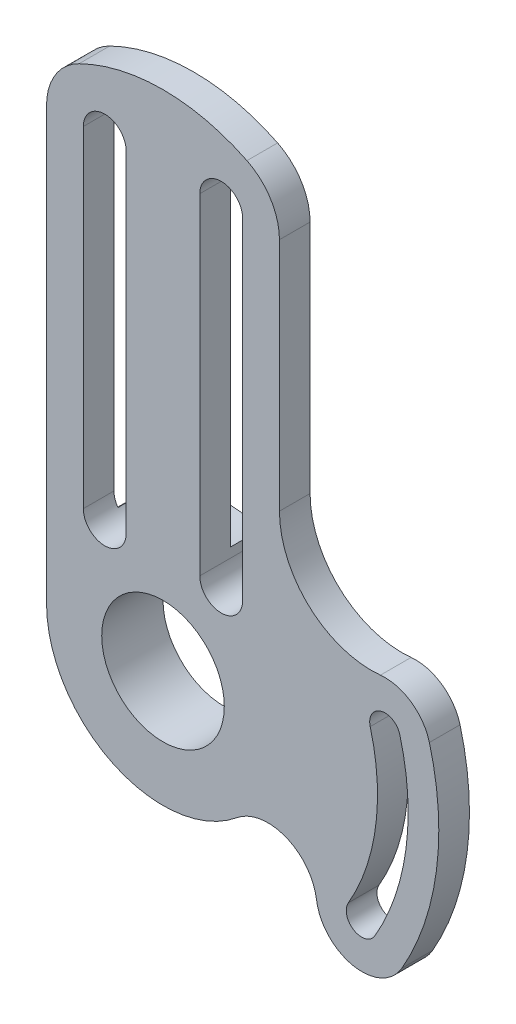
ISO-10303-21;
HEADER;
FILE_DESCRIPTION(('STEP AP214'),'2;1');
FILE_NAME('part.step','',(''),(''),'','','');
FILE_SCHEMA(('AUTOMOTIVE_DESIGN { 1 0 10303 214 1 1 1 1 }'));
ENDSEC;
DATA;
#1=APPLICATION_CONTEXT('core data for automotive mechanical design processes');
#2=APPLICATION_PROTOCOL_DEFINITION('international standard','automotive_design',2000,#1);
#3=PRODUCT_CONTEXT('',#1,'mechanical');
#4=PRODUCT('Part','Part','',(#3));
#5=PRODUCT_RELATED_PRODUCT_CATEGORY('part','',(#4));
#6=PRODUCT_DEFINITION_FORMATION('','',#4);
#7=PRODUCT_DEFINITION_CONTEXT('part definition',#1,'design');
#8=PRODUCT_DEFINITION('design','',#6,#7);
#9=PRODUCT_DEFINITION_SHAPE('','',#8);
#10=(LENGTH_UNIT() NAMED_UNIT(*) SI_UNIT(.MILLI.,.METRE.));
#11=(NAMED_UNIT(*) PLANE_ANGLE_UNIT() SI_UNIT($,.RADIAN.));
#12=(NAMED_UNIT(*) SI_UNIT($,.STERADIAN.) SOLID_ANGLE_UNIT());
#13=UNCERTAINTY_MEASURE_WITH_UNIT(LENGTH_MEASURE(1.E-05),#10,'distance_accuracy_value','');
#14=(GEOMETRIC_REPRESENTATION_CONTEXT(3) GLOBAL_UNCERTAINTY_ASSIGNED_CONTEXT((#13)) GLOBAL_UNIT_ASSIGNED_CONTEXT((#10,
#11,#12)) REPRESENTATION_CONTEXT('',''));
#15=CARTESIAN_POINT('',(0.,0.,0.));
#16=DIRECTION('',(0.,0.,1.));
#17=DIRECTION('',(1.,0.,0.));
#18=AXIS2_PLACEMENT_3D('',#15,#16,#17);
#19=CARTESIAN_POINT('',(-38.,-64.191412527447,10.));
#20=DIRECTION('',(0.,0.,-1.));
#21=DIRECTION('',(-1.,0.,0.));
#22=AXIS2_PLACEMENT_3D('',#19,#20,#21);
#23=CYLINDRICAL_SURFACE('',#22,38.);
#24=CARTESIAN_POINT('',(-38.,-64.191412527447,0.));
#25=DIRECTION('',(0.,0.,-1.));
#26=DIRECTION('',(-1.,0.,0.));
#27=AXIS2_PLACEMENT_3D('',#24,#25,#26);
#28=CIRCLE('',#27,38.);
#29=CARTESIAN_POINT('',(-76.,-64.191412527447,0.));
#30=VERTEX_POINT('',#29);
#31=CARTESIAN_POINT('',(-62.7140407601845,-35.3259281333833,0.));
#32=VERTEX_POINT('',#31);
#33=EDGE_CURVE('E256',#30,#32,#28,.T.);
#34=ORIENTED_EDGE('',*,*,#33,.T.);
#35=DIRECTION('',(0.,0.,1.));
#36=VECTOR('',#35,1.);
#37=CARTESIAN_POINT('',(-62.7140407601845,-35.3259281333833,-10.));
#38=LINE('',#37,#36);
#39=CARTESIAN_POINT('',(-62.7140407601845,-35.3259281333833,-10.));
#40=VERTEX_POINT('',#39);
#41=EDGE_CURVE('E241',#40,#32,#38,.T.);
#42=ORIENTED_EDGE('',*,*,#41,.F.);
#43=CARTESIAN_POINT('',(-38.,-64.191412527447,-10.));
#44=DIRECTION('',(0.,0.,-1.));
#45=DIRECTION('',(-1.,0.,0.));
#46=AXIS2_PLACEMENT_3D('',#43,#44,#45);
#47=CIRCLE('',#46,38.);
#48=CARTESIAN_POINT('',(-13.2859592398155,-35.3259281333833,-10.));
#49=VERTEX_POINT('',#48);
#50=EDGE_CURVE('E238',#49,#40,#47,.T.);
#51=ORIENTED_EDGE('',*,*,#50,.F.);
#52=DIRECTION('',(0.,0.,1.));
#53=VECTOR('',#52,1.);
#54=CARTESIAN_POINT('',(-13.2859592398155,-35.3259281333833,-10.));
#55=LINE('',#54,#53);
#56=CARTESIAN_POINT('',(-13.2859592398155,-35.3259281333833,0.));
#57=VERTEX_POINT('',#56);
#58=EDGE_CURVE('E250',#49,#57,#55,.T.);
#59=ORIENTED_EDGE('',*,*,#58,.T.);
#60=CARTESIAN_POINT('',(-13.9016802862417,-93.5728860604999,0.));
#61=VERTEX_POINT('',#60);
#62=EDGE_CURVE('E42',#57,#61,#28,.T.);
#63=ORIENTED_EDGE('',*,*,#62,.T.);
#64=DIRECTION('',(0.,0.,-1.));
#65=VECTOR('',#64,1.);
#66=CARTESIAN_POINT('',(-13.9016802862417,-93.5728860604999,10.));
#67=LINE('',#66,#65);
#68=CARTESIAN_POINT('',(-13.9016802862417,-93.5728860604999,10.));
#69=VERTEX_POINT('',#68);
#70=EDGE_CURVE('E270',#69,#61,#67,.T.);
#71=ORIENTED_EDGE('',*,*,#70,.F.);
#72=CARTESIAN_POINT('',(-38.,-64.191412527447,10.));
#73=DIRECTION('',(0.,0.,1.));
#74=DIRECTION('',(1.,0.,0.));
#75=AXIS2_PLACEMENT_3D('',#72,#73,#74);
#76=CIRCLE('',#75,38.);
#77=CARTESIAN_POINT('',(-76.,-64.191412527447,10.));
#78=VERTEX_POINT('',#77);
#79=EDGE_CURVE('E381',#78,#69,#76,.T.);
#80=ORIENTED_EDGE('',*,*,#79,.F.);
#81=DIRECTION('',(0.,0.,-1.));
#82=VECTOR('',#81,1.);
#83=CARTESIAN_POINT('',(-76.,-64.191412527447,10.));
#84=LINE('',#83,#82);
#85=EDGE_CURVE('E273',#78,#30,#84,.T.);
#86=ORIENTED_EDGE('',*,*,#85,.T.);
#87=EDGE_LOOP('',(#34,#42,#51,#59,#63,#71,#80,#86));
#88=FACE_BOUND('',#87,.T.);
#89=ADVANCED_FACE('F33',(#88),#23,.T.);
#90=CARTESIAN_POINT('',(30.,0.,0.));
#91=DIRECTION('',(0.,0.,1.));
#92=DIRECTION('',(1.,0.,0.));
#93=AXIS2_PLACEMENT_3D('',#90,#91,#92);
#94=PLANE('',#93);
#95=CARTESIAN_POINT('',(26.8005413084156,-101.95236916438,0.));
#96=DIRECTION('',(0.,0.,1.));
#97=DIRECTION('',(1.,0.,0.));
#98=AXIS2_PLACEMENT_3D('',#95,#96,#97);
#99=CIRCLE('',#98,5.00000000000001);
#100=CARTESIAN_POINT('',(22.4805052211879,-99.434972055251,0.));
#101=VERTEX_POINT('',#100);
#102=CARTESIAN_POINT('',(31.1205773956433,-104.469766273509,0.));
#103=VERTEX_POINT('',#102);
#104=EDGE_CURVE('E465',#101,#103,#99,.T.);
#105=ORIENTED_EDGE('',*,*,#104,.T.);
#106=CARTESIAN_POINT('',(-38.,-64.191412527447,0.));
#107=DIRECTION('',(0.,0.,1.));
#108=DIRECTION('',(1.,0.,0.));
#109=AXIS2_PLACEMENT_3D('',#106,#107,#108);
#110=CIRCLE('',#109,80.);
#111=CARTESIAN_POINT('',(39.2740661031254,-43.4858889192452,0.));
#112=VERTEX_POINT('',#111);
#113=EDGE_CURVE('E462',#103,#112,#110,.T.);
#114=ORIENTED_EDGE('',*,*,#113,.T.);
#115=CARTESIAN_POINT('',(34.4444369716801,-44.7799841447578,0.));
#116=DIRECTION('',(0.,0.,1.));
#117=DIRECTION('',(1.,0.,0.));
#118=AXIS2_PLACEMENT_3D('',#115,#116,#117);
#119=CIRCLE('',#118,5.00000000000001);
#120=CARTESIAN_POINT('',(29.6148078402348,-46.0740793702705,0.));
#121=VERTEX_POINT('',#120);
#122=EDGE_CURVE('E459',#112,#121,#119,.T.);
#123=ORIENTED_EDGE('',*,*,#122,.T.);
#124=CARTESIAN_POINT('',(-38.,-64.191412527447,0.));
#125=DIRECTION('',(0.,0.,-1.));
#126=DIRECTION('',(1.,0.,0.));
#127=AXIS2_PLACEMENT_3D('',#124,#125,#126);
#128=CIRCLE('',#127,70.);
#129=EDGE_CURVE('E455',#121,#101,#128,.T.);
#130=ORIENTED_EDGE('',*,*,#129,.T.);
#131=EDGE_LOOP('',(#105,#114,#123,#130));
#132=FACE_BOUND('',#131,.T.);
#133=ORIENTED_EDGE('',*,*,#33,.F.);
#134=DIRECTION('',(0.,-1.,0.));
#135=VECTOR('',#134,1.);
#136=CARTESIAN_POINT('',(-76.,-64.191412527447,0.));
#137=LINE('',#136,#135);
#138=CARTESIAN_POINT('',(-76.,76.7175528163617,0.));
#139=VERTEX_POINT('',#138);
#140=EDGE_CURVE('E280',#139,#30,#137,.T.);
#141=ORIENTED_EDGE('',*,*,#140,.F.);
#142=CARTESIAN_POINT('',(-57.,76.7175528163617,0.));
#143=DIRECTION('',(0.,0.,1.));
#144=DIRECTION('',(-1.,0.,0.));
#145=AXIS2_PLACEMENT_3D('',#142,#143,#144);
#146=CIRCLE('',#145,19.);
#147=CARTESIAN_POINT('',(-65.3953488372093,93.7621448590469,0.));
#148=VERTEX_POINT('',#147);
#149=EDGE_CURVE('E285',#148,#139,#146,.T.);
#150=ORIENTED_EDGE('',*,*,#149,.F.);
#151=CARTESIAN_POINT('',(-38.,38.1429497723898,0.));
#152=DIRECTION('',(0.,0.,1.));
#153=DIRECTION('',(-1.,0.,0.));
#154=AXIS2_PLACEMENT_3D('',#151,#152,#153);
#155=CIRCLE('',#154,62.);
#156=CARTESIAN_POINT('',(-10.6046511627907,93.7621448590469,0.));
#157=VERTEX_POINT('',#156);
#158=EDGE_CURVE('E340',#157,#148,#155,.T.);
#159=ORIENTED_EDGE('',*,*,#158,.F.);
#160=CARTESIAN_POINT('',(-19.,76.7175528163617,0.));
#161=DIRECTION('',(0.,0.,1.));
#162=DIRECTION('',(-1.,0.,0.));
#163=AXIS2_PLACEMENT_3D('',#160,#161,#162);
#164=CIRCLE('',#163,19.);
#165=CARTESIAN_POINT('',(0.,76.7175528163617,0.));
#166=VERTEX_POINT('',#165);
#167=EDGE_CURVE('E331',#166,#157,#164,.T.);
#168=ORIENTED_EDGE('',*,*,#167,.F.);
#169=DIRECTION('',(0.,1.,0.));
#170=VECTOR('',#169,1.);
#171=CARTESIAN_POINT('',(0.,0.,0.));
#172=LINE('',#171,#170);
#173=CARTESIAN_POINT('',(0.,0.,0.));
#174=VERTEX_POINT('',#173);
#175=EDGE_CURVE('E317',#174,#166,#172,.T.);
#176=ORIENTED_EDGE('',*,*,#175,.F.);
#177=CARTESIAN_POINT('',(30.,0.,0.));
#178=DIRECTION('',(0.,0.,-1.));
#179=DIRECTION('',(1.,0.,0.));
#180=AXIS2_PLACEMENT_3D('',#177,#178,#179);
#181=CIRCLE('',#180,30.);
#182=CARTESIAN_POINT('',(32.9629579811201,-29.8533227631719,0.));
#183=VERTEX_POINT('',#182);
#184=EDGE_CURVE('E324',#183,#174,#181,.T.);
#185=ORIENTED_EDGE('',*,*,#184,.F.);
#186=CARTESIAN_POINT('',(34.4444369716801,-44.7799841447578,0.));
#187=DIRECTION('',(0.,0.,1.));
#188=DIRECTION('',(1.,0.,0.));
#189=AXIS2_PLACEMENT_3D('',#186,#187,#188);
#190=CIRCLE('',#189,15.);
#191=CARTESIAN_POINT('',(48.9333243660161,-40.89769846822,0.));
#192=VERTEX_POINT('',#191);
#193=EDGE_CURVE('E346',#192,#183,#190,.T.);
#194=ORIENTED_EDGE('',*,*,#193,.F.);
#195=CARTESIAN_POINT('',(-38.,-64.191412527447,0.));
#196=DIRECTION('',(0.,0.,1.));
#197=DIRECTION('',(1.,0.,0.));
#198=AXIS2_PLACEMENT_3D('',#195,#196,#197);
#199=CIRCLE('',#198,90.);
#200=CARTESIAN_POINT('',(39.9422863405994,-109.191412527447,0.));
#201=VERTEX_POINT('',#200);
#202=EDGE_CURVE('E344',#201,#192,#199,.T.);
#203=ORIENTED_EDGE('',*,*,#202,.F.);
#204=CARTESIAN_POINT('',(26.9519052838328,-101.691412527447,0.));
#205=DIRECTION('',(0.,0.,1.));
#206=DIRECTION('',(1.,0.,0.));
#207=AXIS2_PLACEMENT_3D('',#204,#205,#206);
#208=CIRCLE('',#207,15.);
#209=CARTESIAN_POINT('',(12.0937159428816,-103.749132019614,0.));
#210=VERTEX_POINT('',#209);
#211=EDGE_CURVE('E279',#210,#201,#208,.T.);
#212=ORIENTED_EDGE('',*,*,#211,.F.);
#213=CARTESIAN_POINT('',(-3.75501935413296,-105.944032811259,0.));
#214=DIRECTION('',(0.,0.,-1.));
#215=DIRECTION('',(-1.,0.,0.));
#216=AXIS2_PLACEMENT_3D('',#213,#214,#215);
#217=CIRCLE('',#216,16.);
#218=EDGE_CURVE('E277',#61,#210,#217,.T.);
#219=ORIENTED_EDGE('',*,*,#218,.F.);
#220=ORIENTED_EDGE('',*,*,#62,.F.);
#221=CARTESIAN_POINT('',(-19.,-31.2824471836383,0.));
#222=DIRECTION('',(0.,0.,1.));
#223=DIRECTION('',(1.,0.,0.));
#224=AXIS2_PLACEMENT_3D('',#221,#222,#223);
#225=CIRCLE('',#224,7.);
#226=CARTESIAN_POINT('',(-12.,-31.2824471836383,0.));
#227=VERTEX_POINT('',#226);
#228=EDGE_CURVE('E429',#57,#227,#225,.T.);
#229=ORIENTED_EDGE('',*,*,#228,.T.);
#230=DIRECTION('',(0.,1.,0.));
#231=VECTOR('',#230,1.);
#232=CARTESIAN_POINT('',(-12.,76.7175528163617,0.));
#233=LINE('',#232,#231);
#234=CARTESIAN_POINT('',(-12.,76.7175528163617,0.));
#235=VERTEX_POINT('',#234);
#236=EDGE_CURVE('E425',#227,#235,#233,.T.);
#237=ORIENTED_EDGE('',*,*,#236,.T.);
#238=CARTESIAN_POINT('',(-19.,76.7175528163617,0.));
#239=DIRECTION('',(0.,0.,1.));
#240=DIRECTION('',(1.,0.,0.));
#241=AXIS2_PLACEMENT_3D('',#238,#239,#240);
#242=CIRCLE('',#241,7.);
#243=CARTESIAN_POINT('',(-26.,76.7175528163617,0.));
#244=VERTEX_POINT('',#243);
#245=EDGE_CURVE('E434',#235,#244,#242,.T.);
#246=ORIENTED_EDGE('',*,*,#245,.T.);
#247=DIRECTION('',(0.,-1.,0.));
#248=VECTOR('',#247,1.);
#249=CARTESIAN_POINT('',(-26.,76.7175528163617,0.));
#250=LINE('',#249,#248);
#251=CARTESIAN_POINT('',(-26.,-28.1358997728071,0.));
#252=VERTEX_POINT('',#251);
#253=EDGE_CURVE('E431',#244,#252,#250,.T.);
#254=ORIENTED_EDGE('',*,*,#253,.T.);
#255=CARTESIAN_POINT('',(-50.,-28.1358997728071,0.));
#256=VERTEX_POINT('',#255);
#257=EDGE_CURVE('E11',#256,#252,#28,.T.);
#258=ORIENTED_EDGE('',*,*,#257,.F.);
#259=DIRECTION('',(0.,1.,0.));
#260=VECTOR('',#259,1.);
#261=CARTESIAN_POINT('',(-50.,76.7175528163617,0.));
#262=LINE('',#261,#260);
#263=CARTESIAN_POINT('',(-50.,76.7175528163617,0.));
#264=VERTEX_POINT('',#263);
#265=EDGE_CURVE('E397',#256,#264,#262,.T.);
#266=ORIENTED_EDGE('',*,*,#265,.T.);
#267=CARTESIAN_POINT('',(-57.,76.7175528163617,0.));
#268=DIRECTION('',(0.,0.,1.));
#269=DIRECTION('',(1.,0.,0.));
#270=AXIS2_PLACEMENT_3D('',#267,#268,#269);
#271=CIRCLE('',#270,7.);
#272=CARTESIAN_POINT('',(-64.,76.7175528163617,0.));
#273=VERTEX_POINT('',#272);
#274=EDGE_CURVE('E406',#264,#273,#271,.T.);
#275=ORIENTED_EDGE('',*,*,#274,.T.);
#276=DIRECTION('',(0.,-1.,0.));
#277=VECTOR('',#276,1.);
#278=CARTESIAN_POINT('',(-64.,76.7175528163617,0.));
#279=LINE('',#278,#277);
#280=CARTESIAN_POINT('',(-64.,-31.2824471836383,0.));
#281=VERTEX_POINT('',#280);
#282=EDGE_CURVE('E403',#273,#281,#279,.T.);
#283=ORIENTED_EDGE('',*,*,#282,.T.);
#284=CARTESIAN_POINT('',(-57.,-31.2824471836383,0.));
#285=DIRECTION('',(0.,0.,1.));
#286=DIRECTION('',(1.,0.,0.));
#287=AXIS2_PLACEMENT_3D('',#284,#285,#286);
#288=CIRCLE('',#287,7.);
#289=EDGE_CURVE('E400',#281,#32,#288,.T.);
#290=ORIENTED_EDGE('',*,*,#289,.T.);
#291=EDGE_LOOP('',(#133,#141,#150,#159,#168,#176,#185,#194,#203,#212,#219,#220,#229,#237,#246,
#254,#258,#266,#275,#283,#290));
#292=FACE_BOUND('',#291,.T.);
#293=ADVANCED_FACE('F368',(#132,#292),#94,.F.);
#294=CARTESIAN_POINT('',(30.,0.,10.));
#295=DIRECTION('',(0.,0.,1.));
#296=DIRECTION('',(1.,0.,0.));
#297=AXIS2_PLACEMENT_3D('',#294,#295,#296);
#298=PLANE('',#297);
#299=CARTESIAN_POINT('',(-38.,-64.191412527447,10.));
#300=DIRECTION('',(0.,0.,1.));
#301=DIRECTION('',(1.,0.,0.));
#302=AXIS2_PLACEMENT_3D('',#299,#300,#301);
#303=CIRCLE('',#302,80.);
#304=CARTESIAN_POINT('',(31.1205773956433,-104.469766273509,10.));
#305=VERTEX_POINT('',#304);
#306=CARTESIAN_POINT('',(39.2740661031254,-43.4858889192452,10.));
#307=VERTEX_POINT('',#306);
#308=EDGE_CURVE('E472',#305,#307,#303,.T.);
#309=ORIENTED_EDGE('',*,*,#308,.F.);
#310=CARTESIAN_POINT('',(26.8005413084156,-101.95236916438,10.));
#311=DIRECTION('',(0.,0.,1.));
#312=DIRECTION('',(1.,0.,0.));
#313=AXIS2_PLACEMENT_3D('',#310,#311,#312);
#314=CIRCLE('',#313,5.00000000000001);
#315=CARTESIAN_POINT('',(22.4805052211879,-99.434972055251,10.));
#316=VERTEX_POINT('',#315);
#317=EDGE_CURVE('E458',#316,#305,#314,.T.);
#318=ORIENTED_EDGE('',*,*,#317,.F.);
#319=CARTESIAN_POINT('',(-38.,-64.191412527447,10.));
#320=DIRECTION('',(0.,0.,-1.));
#321=DIRECTION('',(1.,0.,0.));
#322=AXIS2_PLACEMENT_3D('',#319,#320,#321);
#323=CIRCLE('',#322,70.);
#324=CARTESIAN_POINT('',(29.6148078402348,-46.0740793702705,10.));
#325=VERTEX_POINT('',#324);
#326=EDGE_CURVE('E454',#325,#316,#323,.T.);
#327=ORIENTED_EDGE('',*,*,#326,.F.);
#328=CARTESIAN_POINT('',(34.4444369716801,-44.7799841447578,10.));
#329=DIRECTION('',(0.,0.,1.));
#330=DIRECTION('',(1.,0.,0.));
#331=AXIS2_PLACEMENT_3D('',#328,#329,#330);
#332=CIRCLE('',#331,5.00000000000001);
#333=EDGE_CURVE('E469',#307,#325,#332,.T.);
#334=ORIENTED_EDGE('',*,*,#333,.F.);
#335=EDGE_LOOP('',(#309,#318,#327,#334));
#336=FACE_BOUND('',#335,.T.);
#337=DIRECTION('',(0.,-1.,0.));
#338=VECTOR('',#337,1.);
#339=CARTESIAN_POINT('',(-64.,76.7175528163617,10.));
#340=LINE('',#339,#338);
#341=CARTESIAN_POINT('',(-64.,76.7175528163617,10.));
#342=VERTEX_POINT('',#341);
#343=CARTESIAN_POINT('',(-64.,-31.2824471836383,10.));
#344=VERTEX_POINT('',#343);
#345=EDGE_CURVE('E412',#342,#344,#340,.T.);
#346=ORIENTED_EDGE('',*,*,#345,.F.);
#347=CARTESIAN_POINT('',(-57.,76.7175528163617,10.));
#348=DIRECTION('',(0.,0.,1.));
#349=DIRECTION('',(1.,0.,0.));
#350=AXIS2_PLACEMENT_3D('',#347,#348,#349);
#351=CIRCLE('',#350,7.);
#352=CARTESIAN_POINT('',(-50.,76.7175528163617,10.));
#353=VERTEX_POINT('',#352);
#354=EDGE_CURVE('E399',#353,#342,#351,.T.);
#355=ORIENTED_EDGE('',*,*,#354,.F.);
#356=DIRECTION('',(0.,1.,0.));
#357=VECTOR('',#356,1.);
#358=CARTESIAN_POINT('',(-50.,76.7175528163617,10.));
#359=LINE('',#358,#357);
#360=CARTESIAN_POINT('',(-50.,-31.2824471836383,10.));
#361=VERTEX_POINT('',#360);
#362=EDGE_CURVE('E396',#361,#353,#359,.T.);
#363=ORIENTED_EDGE('',*,*,#362,.F.);
#364=CARTESIAN_POINT('',(-57.,-31.2824471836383,10.));
#365=DIRECTION('',(0.,0.,1.));
#366=DIRECTION('',(1.,0.,0.));
#367=AXIS2_PLACEMENT_3D('',#364,#365,#366);
#368=CIRCLE('',#367,7.);
#369=EDGE_CURVE('E223',#344,#361,#368,.T.);
#370=ORIENTED_EDGE('',*,*,#369,.F.);
#371=EDGE_LOOP('',(#346,#355,#363,#370));
#372=FACE_BOUND('',#371,.T.);
#373=CARTESIAN_POINT('',(30.,0.,10.));
#374=DIRECTION('',(0.,0.,-1.));
#375=DIRECTION('',(1.,0.,0.));
#376=AXIS2_PLACEMENT_3D('',#373,#374,#375);
#377=CIRCLE('',#376,30.);
#378=CARTESIAN_POINT('',(32.9629579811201,-29.8533227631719,10.));
#379=VERTEX_POINT('',#378);
#380=CARTESIAN_POINT('',(0.,0.,10.));
#381=VERTEX_POINT('',#380);
#382=EDGE_CURVE('E348',#379,#381,#377,.T.);
#383=ORIENTED_EDGE('',*,*,#382,.T.);
#384=DIRECTION('',(0.,1.,0.));
#385=VECTOR('',#384,1.);
#386=CARTESIAN_POINT('',(0.,0.,10.));
#387=LINE('',#386,#385);
#388=CARTESIAN_POINT('',(0.,76.7175528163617,10.));
#389=VERTEX_POINT('',#388);
#390=EDGE_CURVE('E318',#381,#389,#387,.T.);
#391=ORIENTED_EDGE('',*,*,#390,.T.);
#392=CARTESIAN_POINT('',(-19.,76.7175528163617,10.));
#393=DIRECTION('',(0.,0.,1.));
#394=DIRECTION('',(-1.,0.,0.));
#395=AXIS2_PLACEMENT_3D('',#392,#393,#394);
#396=CIRCLE('',#395,19.);
#397=CARTESIAN_POINT('',(-10.6046511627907,93.7621448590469,10.));
#398=VERTEX_POINT('',#397);
#399=EDGE_CURVE('E389',#389,#398,#396,.T.);
#400=ORIENTED_EDGE('',*,*,#399,.T.);
#401=CARTESIAN_POINT('',(-38.,38.1429497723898,10.));
#402=DIRECTION('',(0.,0.,1.));
#403=DIRECTION('',(-1.,0.,0.));
#404=AXIS2_PLACEMENT_3D('',#401,#402,#403);
#405=CIRCLE('',#404,62.);
#406=CARTESIAN_POINT('',(-65.3953488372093,93.7621448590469,10.));
#407=VERTEX_POINT('',#406);
#408=EDGE_CURVE('E387',#398,#407,#405,.T.);
#409=ORIENTED_EDGE('',*,*,#408,.T.);
#410=CARTESIAN_POINT('',(-57.,76.7175528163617,10.));
#411=DIRECTION('',(0.,0.,1.));
#412=DIRECTION('',(-1.,0.,0.));
#413=AXIS2_PLACEMENT_3D('',#410,#411,#412);
#414=CIRCLE('',#413,19.);
#415=CARTESIAN_POINT('',(-76.,76.7175528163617,10.));
#416=VERTEX_POINT('',#415);
#417=EDGE_CURVE('E385',#407,#416,#414,.T.);
#418=ORIENTED_EDGE('',*,*,#417,.T.);
#419=DIRECTION('',(0.,-1.,0.));
#420=VECTOR('',#419,1.);
#421=CARTESIAN_POINT('',(-76.,-64.191412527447,10.));
#422=LINE('',#421,#420);
#423=EDGE_CURVE('E383',#416,#78,#422,.T.);
#424=ORIENTED_EDGE('',*,*,#423,.T.);
#425=ORIENTED_EDGE('',*,*,#79,.T.);
#426=CARTESIAN_POINT('',(-3.75501935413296,-105.944032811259,10.));
#427=DIRECTION('',(0.,0.,-1.));
#428=DIRECTION('',(-1.,0.,0.));
#429=AXIS2_PLACEMENT_3D('',#426,#427,#428);
#430=CIRCLE('',#429,16.);
#431=CARTESIAN_POINT('',(12.0937159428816,-103.749132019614,10.));
#432=VERTEX_POINT('',#431);
#433=EDGE_CURVE('E377',#69,#432,#430,.T.);
#434=ORIENTED_EDGE('',*,*,#433,.T.);
#435=CARTESIAN_POINT('',(26.9519052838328,-101.691412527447,10.));
#436=DIRECTION('',(0.,0.,1.));
#437=DIRECTION('',(1.,0.,0.));
#438=AXIS2_PLACEMENT_3D('',#435,#436,#437);
#439=CIRCLE('',#438,15.);
#440=CARTESIAN_POINT('',(39.9422863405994,-109.191412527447,10.));
#441=VERTEX_POINT('',#440);
#442=EDGE_CURVE('E364',#432,#441,#439,.T.);
#443=ORIENTED_EDGE('',*,*,#442,.T.);
#444=CARTESIAN_POINT('',(-38.,-64.191412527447,10.));
#445=DIRECTION('',(0.,0.,1.));
#446=DIRECTION('',(1.,0.,0.));
#447=AXIS2_PLACEMENT_3D('',#444,#445,#446);
#448=CIRCLE('',#447,90.);
#449=CARTESIAN_POINT('',(48.9333243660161,-40.89769846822,10.));
#450=VERTEX_POINT('',#449);
#451=EDGE_CURVE('E376',#441,#450,#448,.T.);
#452=ORIENTED_EDGE('',*,*,#451,.T.);
#453=CARTESIAN_POINT('',(34.4444369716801,-44.7799841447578,10.));
#454=DIRECTION('',(0.,0.,1.));
#455=DIRECTION('',(1.,0.,0.));
#456=AXIS2_PLACEMENT_3D('',#453,#454,#455);
#457=CIRCLE('',#456,15.);
#458=EDGE_CURVE('E336',#450,#379,#457,.T.);
#459=ORIENTED_EDGE('',*,*,#458,.T.);
#460=EDGE_LOOP('',(#383,#391,#400,#409,#418,#424,#425,#434,#443,#452,#459));
#461=FACE_BOUND('',#460,.T.);
#462=DIRECTION('',(0.,-1.,0.));
#463=VECTOR('',#462,1.);
#464=CARTESIAN_POINT('',(-26.,76.7175528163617,10.));
#465=LINE('',#464,#463);
#466=CARTESIAN_POINT('',(-26.,76.7175528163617,10.));
#467=VERTEX_POINT('',#466);
#468=CARTESIAN_POINT('',(-26.,-31.2824471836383,10.));
#469=VERTEX_POINT('',#468);
#470=EDGE_CURVE('E442',#467,#469,#465,.T.);
#471=ORIENTED_EDGE('',*,*,#470,.F.);
#472=CARTESIAN_POINT('',(-19.,76.7175528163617,10.));
#473=DIRECTION('',(0.,0.,1.));
#474=DIRECTION('',(1.,0.,0.));
#475=AXIS2_PLACEMENT_3D('',#472,#473,#474);
#476=CIRCLE('',#475,7.);
#477=CARTESIAN_POINT('',(-12.,76.7175528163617,10.));
#478=VERTEX_POINT('',#477);
#479=EDGE_CURVE('E428',#478,#467,#476,.T.);
#480=ORIENTED_EDGE('',*,*,#479,.F.);
#481=DIRECTION('',(0.,1.,0.));
#482=VECTOR('',#481,1.);
#483=CARTESIAN_POINT('',(-12.,76.7175528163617,10.));
#484=LINE('',#483,#482);
#485=CARTESIAN_POINT('',(-12.,-31.2824471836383,10.));
#486=VERTEX_POINT('',#485);
#487=EDGE_CURVE('E424',#486,#478,#484,.T.);
#488=ORIENTED_EDGE('',*,*,#487,.F.);
#489=CARTESIAN_POINT('',(-19.,-31.2824471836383,10.));
#490=DIRECTION('',(0.,0.,1.));
#491=DIRECTION('',(1.,0.,0.));
#492=AXIS2_PLACEMENT_3D('',#489,#490,#491);
#493=CIRCLE('',#492,7.);
#494=EDGE_CURVE('E439',#469,#486,#493,.T.);
#495=ORIENTED_EDGE('',*,*,#494,.F.);
#496=EDGE_LOOP('',(#471,#480,#488,#495));
#497=FACE_BOUND('',#496,.T.);
#498=CARTESIAN_POINT('',(-38.,-64.191412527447,10.));
#499=DIRECTION('',(0.,0.,1.));
#500=DIRECTION('',(1.,0.,0.));
#501=AXIS2_PLACEMENT_3D('',#498,#499,#500);
#502=CIRCLE('',#501,20.);
#503=CARTESIAN_POINT('',(-18.,-64.191412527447,10.));
#504=VERTEX_POINT('',#503);
#505=EDGE_CURVE('E258',#504,#504,#502,.T.);
#506=ORIENTED_EDGE('',*,*,#505,.F.);
#507=EDGE_LOOP('',(#506));
#508=FACE_BOUND('',#507,.T.);
#509=ADVANCED_FACE('F485',(#336,#372,#461,#497,#508),#298,.T.);
#510=CARTESIAN_POINT('',(30.,0.,10.));
#511=DIRECTION('',(0.,0.,-1.));
#512=DIRECTION('',(-1.,0.,0.));
#513=AXIS2_PLACEMENT_3D('',#510,#511,#512);
#514=CYLINDRICAL_SURFACE('',#513,30.);
#515=ORIENTED_EDGE('',*,*,#184,.T.);
#516=DIRECTION('',(0.,0.,-1.));
#517=VECTOR('',#516,1.);
#518=CARTESIAN_POINT('',(0.,0.,10.));
#519=LINE('',#518,#517);
#520=EDGE_CURVE('E266',#381,#174,#519,.T.);
#521=ORIENTED_EDGE('',*,*,#520,.F.);
#522=ORIENTED_EDGE('',*,*,#382,.F.);
#523=DIRECTION('',(0.,0.,-1.));
#524=VECTOR('',#523,1.);
#525=CARTESIAN_POINT('',(32.9629579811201,-29.8533227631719,10.));
#526=LINE('',#525,#524);
#527=EDGE_CURVE('E326',#379,#183,#526,.T.);
#528=ORIENTED_EDGE('',*,*,#527,.T.);
#529=EDGE_LOOP('',(#515,#521,#522,#528));
#530=FACE_BOUND('',#529,.T.);
#531=ADVANCED_FACE('F35',(#530),#514,.F.);
#532=CARTESIAN_POINT('',(0.,0.,10.));
#533=DIRECTION('',(-1.,0.,0.));
#534=DIRECTION('',(0.,0.,1.));
#535=AXIS2_PLACEMENT_3D('',#532,#533,#534);
#536=PLANE('',#535);
#537=ORIENTED_EDGE('',*,*,#175,.T.);
#538=DIRECTION('',(0.,0.,-1.));
#539=VECTOR('',#538,1.);
#540=CARTESIAN_POINT('',(0.,76.7175528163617,10.));
#541=LINE('',#540,#539);
#542=EDGE_CURVE('E306',#389,#166,#541,.T.);
#543=ORIENTED_EDGE('',*,*,#542,.F.);
#544=ORIENTED_EDGE('',*,*,#390,.F.);
#545=ORIENTED_EDGE('',*,*,#520,.T.);
#546=EDGE_LOOP('',(#537,#543,#544,#545));
#547=FACE_BOUND('',#546,.T.);
#548=ADVANCED_FACE('F316',(#547),#536,.F.);
#549=CARTESIAN_POINT('',(-19.,76.7175528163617,10.));
#550=DIRECTION('',(0.,0.,-1.));
#551=DIRECTION('',(-1.,0.,0.));
#552=AXIS2_PLACEMENT_3D('',#549,#550,#551);
#553=CYLINDRICAL_SURFACE('',#552,19.);
#554=ORIENTED_EDGE('',*,*,#167,.T.);
#555=DIRECTION('',(0.,0.,-1.));
#556=VECTOR('',#555,1.);
#557=CARTESIAN_POINT('',(-10.6046511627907,93.7621448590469,10.));
#558=LINE('',#557,#556);
#559=EDGE_CURVE('E300',#398,#157,#558,.T.);
#560=ORIENTED_EDGE('',*,*,#559,.F.);
#561=ORIENTED_EDGE('',*,*,#399,.F.);
#562=ORIENTED_EDGE('',*,*,#542,.T.);
#563=EDGE_LOOP('',(#554,#560,#561,#562));
#564=FACE_BOUND('',#563,.T.);
#565=ADVANCED_FACE('F555',(#564),#553,.T.);
#566=CARTESIAN_POINT('',(-38.,38.1429497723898,10.));
#567=DIRECTION('',(0.,0.,-1.));
#568=DIRECTION('',(-1.,0.,0.));
#569=AXIS2_PLACEMENT_3D('',#566,#567,#568);
#570=CYLINDRICAL_SURFACE('',#569,62.);
#571=ORIENTED_EDGE('',*,*,#158,.T.);
#572=DIRECTION('',(0.,0.,-1.));
#573=VECTOR('',#572,1.);
#574=CARTESIAN_POINT('',(-65.3953488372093,93.7621448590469,10.));
#575=LINE('',#574,#573);
#576=EDGE_CURVE('E293',#407,#148,#575,.T.);
#577=ORIENTED_EDGE('',*,*,#576,.F.);
#578=ORIENTED_EDGE('',*,*,#408,.F.);
#579=ORIENTED_EDGE('',*,*,#559,.T.);
#580=EDGE_LOOP('',(#571,#577,#578,#579));
#581=FACE_BOUND('',#580,.T.);
#582=ADVANCED_FACE('F560',(#581),#570,.T.);
#583=CARTESIAN_POINT('',(-57.,76.7175528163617,10.));
#584=DIRECTION('',(0.,0.,-1.));
#585=DIRECTION('',(-1.,0.,0.));
#586=AXIS2_PLACEMENT_3D('',#583,#584,#585);
#587=CYLINDRICAL_SURFACE('',#586,19.);
#588=ORIENTED_EDGE('',*,*,#149,.T.);
#589=DIRECTION('',(0.,0.,-1.));
#590=VECTOR('',#589,1.);
#591=CARTESIAN_POINT('',(-76.,76.7175528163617,10.));
#592=LINE('',#591,#590);
#593=EDGE_CURVE('E288',#416,#139,#592,.T.);
#594=ORIENTED_EDGE('',*,*,#593,.F.);
#595=ORIENTED_EDGE('',*,*,#417,.F.);
#596=ORIENTED_EDGE('',*,*,#576,.T.);
#597=EDGE_LOOP('',(#588,#594,#595,#596));
#598=FACE_BOUND('',#597,.T.);
#599=ADVANCED_FACE('F523',(#598),#587,.T.);
#600=CARTESIAN_POINT('',(-76.,-64.191412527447,10.));
#601=DIRECTION('',(1.,0.,0.));
#602=DIRECTION('',(0.,1.,0.));
#603=AXIS2_PLACEMENT_3D('',#600,#601,#602);
#604=PLANE('',#603);
#605=ORIENTED_EDGE('',*,*,#140,.T.);
#606=ORIENTED_EDGE('',*,*,#85,.F.);
#607=ORIENTED_EDGE('',*,*,#423,.F.);
#608=ORIENTED_EDGE('',*,*,#593,.T.);
#609=EDGE_LOOP('',(#605,#606,#607,#608));
#610=FACE_BOUND('',#609,.T.);
#611=ADVANCED_FACE('F516',(#610),#604,.F.);
#612=CARTESIAN_POINT('',(-50.,-28.1358997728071,-10.));
#613=VERTEX_POINT('',#612);
#614=CARTESIAN_POINT('',(-26.,-28.1358997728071,-10.));
#615=VERTEX_POINT('',#614);
#616=EDGE_CURVE('E259',#613,#615,#47,.T.);
#617=ORIENTED_EDGE('',*,*,#616,.F.);
#618=DIRECTION('',(0.,0.,1.));
#619=VECTOR('',#618,1.);
#620=CARTESIAN_POINT('',(-50.,-28.1358997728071,-10.));
#621=LINE('',#620,#619);
#622=EDGE_CURVE('E50',#613,#256,#621,.T.);
#623=ORIENTED_EDGE('',*,*,#622,.T.);
#624=ORIENTED_EDGE('',*,*,#257,.T.);
#625=DIRECTION('',(0.,0.,1.));
#626=VECTOR('',#625,1.);
#627=CARTESIAN_POINT('',(-26.,-28.1358997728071,-10.));
#628=LINE('',#627,#626);
#629=EDGE_CURVE('E249',#615,#252,#628,.T.);
#630=ORIENTED_EDGE('',*,*,#629,.F.);
#631=EDGE_LOOP('',(#617,#623,#624,#630));
#632=FACE_BOUND('',#631,.T.);
#633=ADVANCED_FACE('F507',(#632),#23,.T.);
#634=CARTESIAN_POINT('',(-3.75501935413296,-105.944032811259,10.));
#635=DIRECTION('',(0.,0.,-1.));
#636=DIRECTION('',(-1.,0.,0.));
#637=AXIS2_PLACEMENT_3D('',#634,#635,#636);
#638=CYLINDRICAL_SURFACE('',#637,16.);
#639=ORIENTED_EDGE('',*,*,#218,.T.);
#640=DIRECTION('',(0.,0.,-1.));
#641=VECTOR('',#640,1.);
#642=CARTESIAN_POINT('',(12.0937159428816,-103.749132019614,10.));
#643=LINE('',#642,#641);
#644=EDGE_CURVE('E274',#432,#210,#643,.T.);
#645=ORIENTED_EDGE('',*,*,#644,.F.);
#646=ORIENTED_EDGE('',*,*,#433,.F.);
#647=ORIENTED_EDGE('',*,*,#70,.T.);
#648=EDGE_LOOP('',(#639,#645,#646,#647));
#649=FACE_BOUND('',#648,.T.);
#650=ADVANCED_FACE('F515',(#649),#638,.F.);
#651=CARTESIAN_POINT('',(26.9519052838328,-101.691412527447,10.));
#652=DIRECTION('',(0.,0.,-1.));
#653=DIRECTION('',(-1.,0.,0.));
#654=AXIS2_PLACEMENT_3D('',#651,#652,#653);
#655=CYLINDRICAL_SURFACE('',#654,15.);
#656=ORIENTED_EDGE('',*,*,#211,.T.);
#657=DIRECTION('',(0.,0.,-1.));
#658=VECTOR('',#657,1.);
#659=CARTESIAN_POINT('',(39.9422863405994,-109.191412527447,10.));
#660=LINE('',#659,#658);
#661=EDGE_CURVE('E352',#441,#201,#660,.T.);
#662=ORIENTED_EDGE('',*,*,#661,.F.);
#663=ORIENTED_EDGE('',*,*,#442,.F.);
#664=ORIENTED_EDGE('',*,*,#644,.T.);
#665=EDGE_LOOP('',(#656,#662,#663,#664));
#666=FACE_BOUND('',#665,.T.);
#667=ADVANCED_FACE('F363',(#666),#655,.T.);
#668=CARTESIAN_POINT('',(-38.,-64.191412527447,10.));
#669=DIRECTION('',(0.,0.,-1.));
#670=DIRECTION('',(-1.,0.,0.));
#671=AXIS2_PLACEMENT_3D('',#668,#669,#670);
#672=CYLINDRICAL_SURFACE('',#671,90.);
#673=ORIENTED_EDGE('',*,*,#202,.T.);
#674=DIRECTION('',(0.,0.,-1.));
#675=VECTOR('',#674,1.);
#676=CARTESIAN_POINT('',(48.9333243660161,-40.89769846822,10.));
#677=LINE('',#676,#675);
#678=EDGE_CURVE('E350',#450,#192,#677,.T.);
#679=ORIENTED_EDGE('',*,*,#678,.F.);
#680=ORIENTED_EDGE('',*,*,#451,.F.);
#681=ORIENTED_EDGE('',*,*,#661,.T.);
#682=EDGE_LOOP('',(#673,#679,#680,#681));
#683=FACE_BOUND('',#682,.T.);
#684=ADVANCED_FACE('F371',(#683),#672,.T.);
#685=CARTESIAN_POINT('',(34.4444369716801,-44.7799841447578,10.));
#686=DIRECTION('',(0.,0.,-1.));
#687=DIRECTION('',(-1.,0.,0.));
#688=AXIS2_PLACEMENT_3D('',#685,#686,#687);
#689=CYLINDRICAL_SURFACE('',#688,15.);
#690=ORIENTED_EDGE('',*,*,#193,.T.);
#691=ORIENTED_EDGE('',*,*,#527,.F.);
#692=ORIENTED_EDGE('',*,*,#458,.F.);
#693=ORIENTED_EDGE('',*,*,#678,.T.);
#694=EDGE_LOOP('',(#690,#691,#692,#693));
#695=FACE_BOUND('',#694,.T.);
#696=ADVANCED_FACE('F374',(#695),#689,.T.);
#697=CARTESIAN_POINT('',(-57.,76.7175528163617,10.));
#698=DIRECTION('',(0.,0.,-1.));
#699=DIRECTION('',(-1.,0.,0.));
#700=AXIS2_PLACEMENT_3D('',#697,#698,#699);
#701=CYLINDRICAL_SURFACE('',#700,7.);
#702=ORIENTED_EDGE('',*,*,#274,.F.);
#703=DIRECTION('',(0.,0.,-1.));
#704=VECTOR('',#703,1.);
#705=CARTESIAN_POINT('',(-50.,76.7175528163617,10.));
#706=LINE('',#705,#704);
#707=EDGE_CURVE('E226',#353,#264,#706,.T.);
#708=ORIENTED_EDGE('',*,*,#707,.F.);
#709=ORIENTED_EDGE('',*,*,#354,.T.);
#710=DIRECTION('',(0.,0.,-1.));
#711=VECTOR('',#710,1.);
#712=CARTESIAN_POINT('',(-64.,76.7175528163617,10.));
#713=LINE('',#712,#711);
#714=EDGE_CURVE('E329',#342,#273,#713,.T.);
#715=ORIENTED_EDGE('',*,*,#714,.T.);
#716=EDGE_LOOP('',(#702,#708,#709,#715));
#717=FACE_BOUND('',#716,.T.);
#718=ADVANCED_FACE('F549',(#717),#701,.F.);
#719=CARTESIAN_POINT('',(-64.,76.7175528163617,10.));
#720=DIRECTION('',(1.,0.,0.));
#721=DIRECTION('',(0.,0.,-1.));
#722=AXIS2_PLACEMENT_3D('',#719,#720,#721);
#723=PLANE('',#722);
#724=ORIENTED_EDGE('',*,*,#282,.F.);
#725=ORIENTED_EDGE('',*,*,#714,.F.);
#726=ORIENTED_EDGE('',*,*,#345,.T.);
#727=DIRECTION('',(0.,0.,-1.));
#728=VECTOR('',#727,1.);
#729=CARTESIAN_POINT('',(-64.,-31.2824471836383,10.));
#730=LINE('',#729,#728);
#731=EDGE_CURVE('E225',#344,#281,#730,.T.);
#732=ORIENTED_EDGE('',*,*,#731,.T.);
#733=EDGE_LOOP('',(#724,#725,#726,#732));
#734=FACE_BOUND('',#733,.T.);
#735=ADVANCED_FACE('F546',(#734),#723,.T.);
#736=CARTESIAN_POINT('',(-57.,-31.2824471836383,10.));
#737=DIRECTION('',(0.,0.,-1.));
#738=DIRECTION('',(-1.,0.,0.));
#739=AXIS2_PLACEMENT_3D('',#736,#737,#738);
#740=CYLINDRICAL_SURFACE('',#739,7.);
#741=ORIENTED_EDGE('',*,*,#289,.F.);
#742=ORIENTED_EDGE('',*,*,#731,.F.);
#743=ORIENTED_EDGE('',*,*,#369,.T.);
#744=DIRECTION('',(0.,0.,-1.));
#745=VECTOR('',#744,1.);
#746=CARTESIAN_POINT('',(-50.,-31.2824471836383,10.));
#747=LINE('',#746,#745);
#748=CARTESIAN_POINT('',(-50.,-31.2824471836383,-10.));
#749=VERTEX_POINT('',#748);
#750=EDGE_CURVE('E215',#361,#749,#747,.T.);
#751=ORIENTED_EDGE('',*,*,#750,.T.);
#752=CARTESIAN_POINT('',(-57.,-31.2824471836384,-10.));
#753=DIRECTION('',(0.,0.,1.));
#754=DIRECTION('',(-1.,0.,0.));
#755=AXIS2_PLACEMENT_3D('',#752,#753,#754);
#756=CIRCLE('',#755,6.99999999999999);
#757=EDGE_CURVE('E219',#40,#749,#756,.T.);
#758=ORIENTED_EDGE('',*,*,#757,.F.);
#759=ORIENTED_EDGE('',*,*,#41,.T.);
#760=EDGE_LOOP('',(#741,#742,#743,#751,#758,#759));
#761=FACE_BOUND('',#760,.T.);
#762=ADVANCED_FACE('F217',(#761),#740,.F.);
#763=CARTESIAN_POINT('',(-50.,76.7175528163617,10.));
#764=DIRECTION('',(-1.,0.,0.));
#765=DIRECTION('',(0.,0.,1.));
#766=AXIS2_PLACEMENT_3D('',#763,#764,#765);
#767=PLANE('',#766);
#768=ORIENTED_EDGE('',*,*,#265,.F.);
#769=ORIENTED_EDGE('',*,*,#622,.F.);
#770=DIRECTION('',(0.,1.,0.));
#771=VECTOR('',#770,1.);
#772=CARTESIAN_POINT('',(-50.,-28.1358997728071,-10.));
#773=LINE('',#772,#771);
#774=EDGE_CURVE('E228',#749,#613,#773,.T.);
#775=ORIENTED_EDGE('',*,*,#774,.F.);
#776=ORIENTED_EDGE('',*,*,#750,.F.);
#777=ORIENTED_EDGE('',*,*,#362,.T.);
#778=ORIENTED_EDGE('',*,*,#707,.T.);
#779=EDGE_LOOP('',(#768,#769,#775,#776,#777,#778));
#780=FACE_BOUND('',#779,.T.);
#781=ADVANCED_FACE('F229',(#780),#767,.T.);
#782=CARTESIAN_POINT('',(-19.,76.7175528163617,10.));
#783=DIRECTION('',(0.,0.,-1.));
#784=DIRECTION('',(-1.,0.,0.));
#785=AXIS2_PLACEMENT_3D('',#782,#783,#784);
#786=CYLINDRICAL_SURFACE('',#785,7.);
#787=ORIENTED_EDGE('',*,*,#245,.F.);
#788=DIRECTION('',(0.,0.,-1.));
#789=VECTOR('',#788,1.);
#790=CARTESIAN_POINT('',(-12.,76.7175528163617,10.));
#791=LINE('',#790,#789);
#792=EDGE_CURVE('E421',#478,#235,#791,.T.);
#793=ORIENTED_EDGE('',*,*,#792,.F.);
#794=ORIENTED_EDGE('',*,*,#479,.T.);
#795=DIRECTION('',(0.,0.,-1.));
#796=VECTOR('',#795,1.);
#797=CARTESIAN_POINT('',(-26.,76.7175528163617,10.));
#798=LINE('',#797,#796);
#799=EDGE_CURVE('E409',#467,#244,#798,.T.);
#800=ORIENTED_EDGE('',*,*,#799,.T.);
#801=EDGE_LOOP('',(#787,#793,#794,#800));
#802=FACE_BOUND('',#801,.T.);
#803=ADVANCED_FACE('F531',(#802),#786,.F.);
#804=CARTESIAN_POINT('',(-26.,76.7175528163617,10.));
#805=DIRECTION('',(1.,0.,0.));
#806=DIRECTION('',(0.,1.,0.));
#807=AXIS2_PLACEMENT_3D('',#804,#805,#806);
#808=PLANE('',#807);
#809=ORIENTED_EDGE('',*,*,#253,.F.);
#810=ORIENTED_EDGE('',*,*,#799,.F.);
#811=ORIENTED_EDGE('',*,*,#470,.T.);
#812=DIRECTION('',(0.,0.,-1.));
#813=VECTOR('',#812,1.);
#814=CARTESIAN_POINT('',(-26.,-31.2824471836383,10.));
#815=LINE('',#814,#813);
#816=CARTESIAN_POINT('',(-26.,-31.2824471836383,-10.));
#817=VERTEX_POINT('',#816);
#818=EDGE_CURVE('E58',#469,#817,#815,.T.);
#819=ORIENTED_EDGE('',*,*,#818,.T.);
#820=DIRECTION('',(0.,-1.,0.));
#821=VECTOR('',#820,1.);
#822=CARTESIAN_POINT('',(-26.,-28.1358997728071,-10.));
#823=LINE('',#822,#821);
#824=EDGE_CURVE('E243',#615,#817,#823,.T.);
#825=ORIENTED_EDGE('',*,*,#824,.F.);
#826=ORIENTED_EDGE('',*,*,#629,.T.);
#827=EDGE_LOOP('',(#809,#810,#811,#819,#825,#826));
#828=FACE_BOUND('',#827,.T.);
#829=ADVANCED_FACE('F526',(#828),#808,.T.);
#830=CARTESIAN_POINT('',(-19.,-31.2824471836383,10.));
#831=DIRECTION('',(0.,0.,-1.));
#832=DIRECTION('',(-1.,0.,0.));
#833=AXIS2_PLACEMENT_3D('',#830,#831,#832);
#834=CYLINDRICAL_SURFACE('',#833,7.);
#835=ORIENTED_EDGE('',*,*,#228,.F.);
#836=ORIENTED_EDGE('',*,*,#58,.F.);
#837=CARTESIAN_POINT('',(-19.,-31.2824471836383,-10.));
#838=DIRECTION('',(0.,0.,1.));
#839=DIRECTION('',(1.,0.,0.));
#840=AXIS2_PLACEMENT_3D('',#837,#838,#839);
#841=CIRCLE('',#840,7.);
#842=EDGE_CURVE('E247',#817,#49,#841,.T.);
#843=ORIENTED_EDGE('',*,*,#842,.F.);
#844=ORIENTED_EDGE('',*,*,#818,.F.);
#845=ORIENTED_EDGE('',*,*,#494,.T.);
#846=DIRECTION('',(0.,0.,-1.));
#847=VECTOR('',#846,1.);
#848=CARTESIAN_POINT('',(-12.,-31.2824471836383,10.));
#849=LINE('',#848,#847);
#850=EDGE_CURVE('E418',#486,#227,#849,.T.);
#851=ORIENTED_EDGE('',*,*,#850,.T.);
#852=EDGE_LOOP('',(#835,#836,#843,#844,#845,#851));
#853=FACE_BOUND('',#852,.T.);
#854=ADVANCED_FACE('F542',(#853),#834,.F.);
#855=CARTESIAN_POINT('',(-12.,76.7175528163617,10.));
#856=DIRECTION('',(-1.,0.,0.));
#857=DIRECTION('',(0.,-1.,0.));
#858=AXIS2_PLACEMENT_3D('',#855,#856,#857);
#859=PLANE('',#858);
#860=ORIENTED_EDGE('',*,*,#236,.F.);
#861=ORIENTED_EDGE('',*,*,#850,.F.);
#862=ORIENTED_EDGE('',*,*,#487,.T.);
#863=ORIENTED_EDGE('',*,*,#792,.T.);
#864=EDGE_LOOP('',(#860,#861,#862,#863));
#865=FACE_BOUND('',#864,.T.);
#866=ADVANCED_FACE('F534',(#865),#859,.T.);
#867=CARTESIAN_POINT('',(26.8005413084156,-101.95236916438,10.));
#868=DIRECTION('',(0.,0.,-1.));
#869=DIRECTION('',(-1.,0.,0.));
#870=AXIS2_PLACEMENT_3D('',#867,#868,#869);
#871=CYLINDRICAL_SURFACE('',#870,5.00000000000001);
#872=ORIENTED_EDGE('',*,*,#104,.F.);
#873=DIRECTION('',(0.,0.,-1.));
#874=VECTOR('',#873,1.);
#875=CARTESIAN_POINT('',(22.4805052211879,-99.434972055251,10.));
#876=LINE('',#875,#874);
#877=EDGE_CURVE('E451',#316,#101,#876,.T.);
#878=ORIENTED_EDGE('',*,*,#877,.F.);
#879=ORIENTED_EDGE('',*,*,#317,.T.);
#880=DIRECTION('',(0.,0.,-1.));
#881=VECTOR('',#880,1.);
#882=CARTESIAN_POINT('',(31.1205773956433,-104.469766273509,10.));
#883=LINE('',#882,#881);
#884=EDGE_CURVE('E437',#305,#103,#883,.T.);
#885=ORIENTED_EDGE('',*,*,#884,.T.);
#886=EDGE_LOOP('',(#872,#878,#879,#885));
#887=FACE_BOUND('',#886,.T.);
#888=ADVANCED_FACE('F477',(#887),#871,.F.);
#889=CARTESIAN_POINT('',(-38.,-64.191412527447,10.));
#890=DIRECTION('',(0.,0.,-1.));
#891=DIRECTION('',(-1.,0.,0.));
#892=AXIS2_PLACEMENT_3D('',#889,#890,#891);
#893=CYLINDRICAL_SURFACE('',#892,80.);
#894=ORIENTED_EDGE('',*,*,#113,.F.);
#895=ORIENTED_EDGE('',*,*,#884,.F.);
#896=ORIENTED_EDGE('',*,*,#308,.T.);
#897=DIRECTION('',(0.,0.,-1.));
#898=VECTOR('',#897,1.);
#899=CARTESIAN_POINT('',(39.2740661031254,-43.4858889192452,10.));
#900=LINE('',#899,#898);
#901=EDGE_CURVE('E447',#307,#112,#900,.T.);
#902=ORIENTED_EDGE('',*,*,#901,.T.);
#903=EDGE_LOOP('',(#894,#895,#896,#902));
#904=FACE_BOUND('',#903,.T.);
#905=ADVANCED_FACE('F482',(#904),#893,.F.);
#906=CARTESIAN_POINT('',(34.4444369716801,-44.7799841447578,10.));
#907=DIRECTION('',(0.,0.,-1.));
#908=DIRECTION('',(-1.,0.,0.));
#909=AXIS2_PLACEMENT_3D('',#906,#907,#908);
#910=CYLINDRICAL_SURFACE('',#909,5.00000000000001);
#911=ORIENTED_EDGE('',*,*,#122,.F.);
#912=ORIENTED_EDGE('',*,*,#901,.F.);
#913=ORIENTED_EDGE('',*,*,#333,.T.);
#914=DIRECTION('',(0.,0.,-1.));
#915=VECTOR('',#914,1.);
#916=CARTESIAN_POINT('',(29.6148078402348,-46.0740793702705,10.));
#917=LINE('',#916,#915);
#918=EDGE_CURVE('E449',#325,#121,#917,.T.);
#919=ORIENTED_EDGE('',*,*,#918,.T.);
#920=EDGE_LOOP('',(#911,#912,#913,#919));
#921=FACE_BOUND('',#920,.T.);
#922=ADVANCED_FACE('F489',(#921),#910,.F.);
#923=CARTESIAN_POINT('',(-38.,-64.191412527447,10.));
#924=DIRECTION('',(0.,0.,-1.));
#925=DIRECTION('',(-1.,0.,0.));
#926=AXIS2_PLACEMENT_3D('',#923,#924,#925);
#927=CYLINDRICAL_SURFACE('',#926,70.);
#928=ORIENTED_EDGE('',*,*,#129,.F.);
#929=ORIENTED_EDGE('',*,*,#918,.F.);
#930=ORIENTED_EDGE('',*,*,#326,.T.);
#931=ORIENTED_EDGE('',*,*,#877,.T.);
#932=EDGE_LOOP('',(#928,#929,#930,#931));
#933=FACE_BOUND('',#932,.T.);
#934=ADVANCED_FACE('F493',(#933),#927,.T.);
#935=CARTESIAN_POINT('',(-38.,-64.191412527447,10.));
#936=DIRECTION('',(0.,0.,-1.));
#937=DIRECTION('',(-1.,0.,0.));
#938=AXIS2_PLACEMENT_3D('',#935,#936,#937);
#939=CYLINDRICAL_SURFACE('',#938,20.);
#940=ORIENTED_EDGE('',*,*,#505,.T.);
#941=EDGE_LOOP('',(#940));
#942=FACE_BOUND('',#941,.T.);
#943=CARTESIAN_POINT('',(-38.,-64.191412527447,-10.));
#944=DIRECTION('',(0.,0.,-1.));
#945=DIRECTION('',(-1.,0.,0.));
#946=AXIS2_PLACEMENT_3D('',#943,#944,#945);
#947=CIRCLE('',#946,20.);
#948=CARTESIAN_POINT('',(-58.,-64.191412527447,-10.));
#949=VERTEX_POINT('',#948);
#950=EDGE_CURVE('E252',#949,#949,#947,.T.);
#951=ORIENTED_EDGE('',*,*,#950,.T.);
#952=EDGE_LOOP('',(#951));
#953=FACE_BOUND('',#952,.T.);
#954=ADVANCED_FACE('F495',(#942,#953),#939,.F.);
#955=CARTESIAN_POINT('',(-38.,-64.191412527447,-10.));
#956=DIRECTION('',(0.,0.,-1.));
#957=DIRECTION('',(-1.,0.,0.));
#958=AXIS2_PLACEMENT_3D('',#955,#956,#957);
#959=PLANE('',#958);
#960=ORIENTED_EDGE('',*,*,#757,.T.);
#961=ORIENTED_EDGE('',*,*,#774,.T.);
#962=ORIENTED_EDGE('',*,*,#616,.T.);
#963=ORIENTED_EDGE('',*,*,#824,.T.);
#964=ORIENTED_EDGE('',*,*,#842,.T.);
#965=ORIENTED_EDGE('',*,*,#50,.T.);
#966=EDGE_LOOP('',(#960,#961,#962,#963,#964,#965));
#967=FACE_BOUND('',#966,.T.);
#968=ORIENTED_EDGE('',*,*,#950,.F.);
#969=EDGE_LOOP('',(#968));
#970=FACE_BOUND('',#969,.T.);
#971=ADVANCED_FACE('F234',(#967,#970),#959,.T.);
#972=CLOSED_SHELL('',(#89,#293,#509,#531,#548,#565,#582,#599,#611,#633,#650,#667,#684,#696,#718,
#735,#762,#781,#803,#829,#854,#866,#888,#905,#922,#934,#954,#971));
#973=MANIFOLD_SOLID_BREP('B2',#972);
#974=ADVANCED_BREP_SHAPE_REPRESENTATION('',(#18,#973),#14);
#975=SHAPE_DEFINITION_REPRESENTATION(#9,#974);
ENDSEC;
END-ISO-10303-21;
